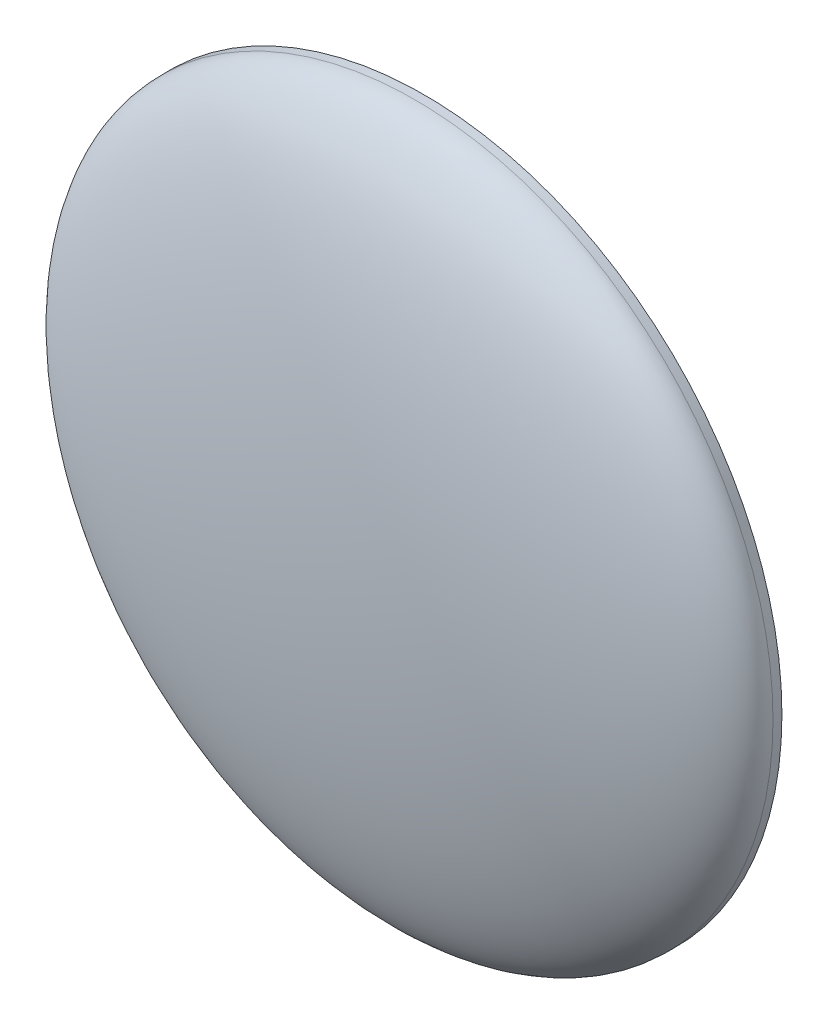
ISO-10303-21;
HEADER;
FILE_DESCRIPTION(('STEP AP214'),'2;1');
FILE_NAME('part.step','',(''),(''),'','','');
FILE_SCHEMA(('AUTOMOTIVE_DESIGN { 1 0 10303 214 1 1 1 1 }'));
ENDSEC;
DATA;
#1=APPLICATION_CONTEXT('core data for automotive mechanical design processes');
#2=APPLICATION_PROTOCOL_DEFINITION('international standard','automotive_design',2000,#1);
#3=PRODUCT_CONTEXT('',#1,'mechanical');
#4=PRODUCT('Part','Part','',(#3));
#5=PRODUCT_RELATED_PRODUCT_CATEGORY('part','',(#4));
#6=PRODUCT_DEFINITION_FORMATION('','',#4);
#7=PRODUCT_DEFINITION_CONTEXT('part definition',#1,'design');
#8=PRODUCT_DEFINITION('design','',#6,#7);
#9=PRODUCT_DEFINITION_SHAPE('','',#8);
#10=(LENGTH_UNIT() NAMED_UNIT(*) SI_UNIT(.MILLI.,.METRE.));
#11=(NAMED_UNIT(*) PLANE_ANGLE_UNIT() SI_UNIT($,.RADIAN.));
#12=(NAMED_UNIT(*) SI_UNIT($,.STERADIAN.) SOLID_ANGLE_UNIT());
#13=UNCERTAINTY_MEASURE_WITH_UNIT(LENGTH_MEASURE(1.E-05),#10,'distance_accuracy_value','');
#14=(GEOMETRIC_REPRESENTATION_CONTEXT(3) GLOBAL_UNCERTAINTY_ASSIGNED_CONTEXT((#13)) GLOBAL_UNIT_ASSIGNED_CONTEXT((#10,
#11,#12)) REPRESENTATION_CONTEXT('',''));
#15=CARTESIAN_POINT('',(0.,0.,0.));
#16=DIRECTION('',(0.,0.,1.));
#17=DIRECTION('',(1.,0.,0.));
#18=AXIS2_PLACEMENT_3D('',#15,#16,#17);
#19=CARTESIAN_POINT('',(0.,0.,0.1));
#20=DIRECTION('',(0.,0.,-1.));
#21=DIRECTION('',(-1.,0.,0.));
#22=AXIS2_PLACEMENT_3D('',#19,#20,#21);
#23=CYLINDRICAL_SURFACE('',#22,4.);
#24=CARTESIAN_POINT('',(0.,0.,0.1));
#25=DIRECTION('',(0.,0.,1.));
#26=DIRECTION('',(1.,0.,0.));
#27=AXIS2_PLACEMENT_3D('',#24,#25,#26);
#28=CIRCLE('',#27,4.);
#29=CARTESIAN_POINT('',(4.,0.,0.1));
#30=VERTEX_POINT('',#29);
#31=EDGE_CURVE('E11',#30,#30,#28,.T.);
#32=ORIENTED_EDGE('',*,*,#31,.F.);
#33=EDGE_LOOP('',(#32));
#34=FACE_BOUND('',#33,.T.);
#35=CARTESIAN_POINT('',(0.,0.,0.));
#36=DIRECTION('',(0.,0.,1.));
#37=DIRECTION('',(1.,0.,0.));
#38=AXIS2_PLACEMENT_3D('',#35,#36,#37);
#39=CIRCLE('',#38,4.);
#40=CARTESIAN_POINT('',(4.,0.,0.));
#41=VERTEX_POINT('',#40);
#42=EDGE_CURVE('E39',#41,#41,#39,.T.);
#43=ORIENTED_EDGE('',*,*,#42,.T.);
#44=EDGE_LOOP('',(#43));
#45=FACE_BOUND('',#44,.T.);
#46=ADVANCED_FACE('F31',(#34,#45),#23,.T.);
#47=CARTESIAN_POINT('',(0.,0.,0.1));
#48=DIRECTION('',(0.,1.,0.));
#49=DIRECTION('',(1.,0.,0.));
#50=AXIS2_PLACEMENT_3D('',#47,#48,#49);
#51=ELLIPSE('',#50,4.,1.);
#52=TRIMMED_CURVE('',#51,(PARAMETER_VALUE(4.71238898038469)),
(PARAMETER_VALUE(7.85398163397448)),.T.,.PARAMETER.);
#53=CARTESIAN_POINT('',(0.,0.,-0.9));
#54=DIRECTION('',(0.,0.,1.));
#55=AXIS1_PLACEMENT('',#53,#54);
#56=SURFACE_OF_REVOLUTION('',#52,#55);
#57=CARTESIAN_POINT('',(0.,0.,1.1));
#58=VERTEX_POINT('',#57);
#59=VERTEX_LOOP('',#58);
#60=FACE_BOUND('',#59,.T.);
#61=ORIENTED_EDGE('',*,*,#31,.T.);
#62=EDGE_LOOP('',(#61));
#63=FACE_BOUND('',#62,.T.);
#64=ADVANCED_FACE('F33',(#60,#63),#56,.F.);
#65=CARTESIAN_POINT('',(0.,0.,0.));
#66=DIRECTION('',(0.,0.,1.));
#67=DIRECTION('',(1.,0.,0.));
#68=AXIS2_PLACEMENT_3D('',#65,#66,#67);
#69=PLANE('',#68);
#70=ORIENTED_EDGE('',*,*,#42,.F.);
#71=EDGE_LOOP('',(#70));
#72=FACE_BOUND('',#71,.T.);
#73=ADVANCED_FACE('F44',(#72),#69,.F.);
#74=CLOSED_SHELL('',(#46,#64,#73));
#75=MANIFOLD_SOLID_BREP('B2',#74);
#76=ADVANCED_BREP_SHAPE_REPRESENTATION('',(#18,#75),#14);
#77=SHAPE_DEFINITION_REPRESENTATION(#9,#76);
ENDSEC;
END-ISO-10303-21;
